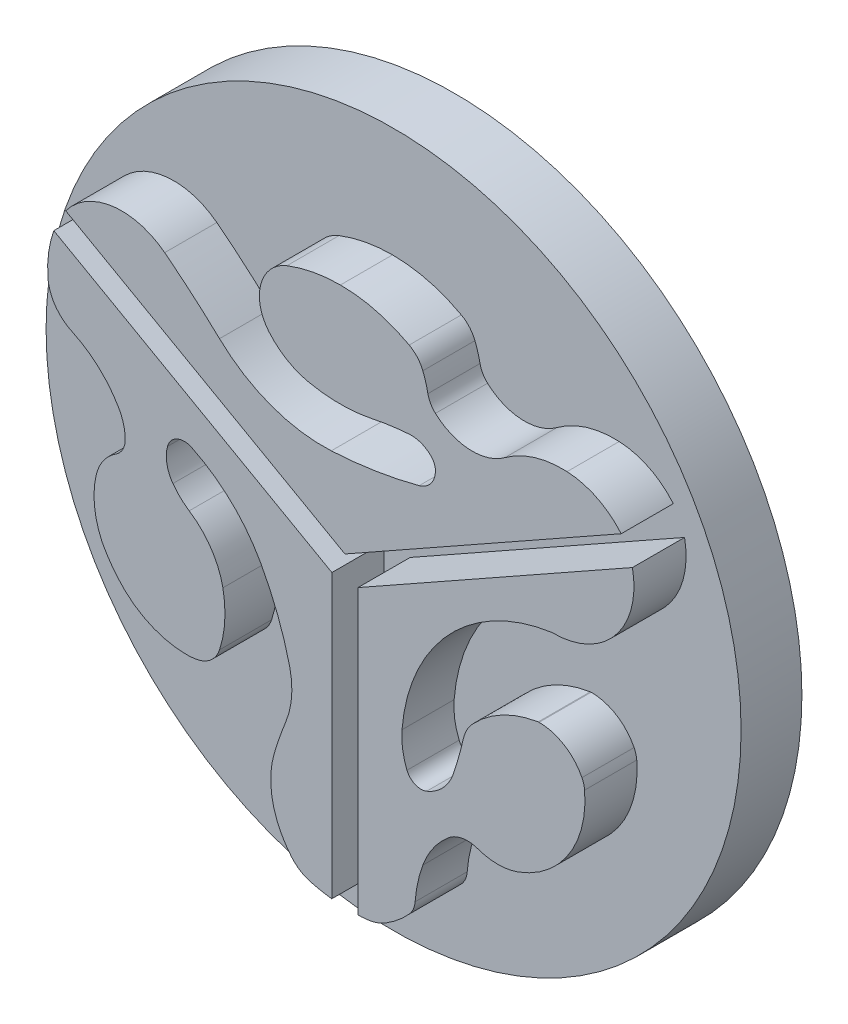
from build123d import *

# Parameters (mm, degrees)
CROQUIS1_R              = 40
SALIENTE_EXTRUIR1_DEPTH = 7
SALIENTE_EXTRUIR2_DEPTH = 6


with BuildPart() as part:
    # Croquis1 → Saliente-Extruir1 (new body)
    with BuildSketch(Plane.XY):
        Circle(CROQUIS1_R)
    extrude(amount=SALIENTE_EXTRUIR1_DEPTH)

    # Croquis2 → Saliente-Extruir2 (add)
    with BuildSketch(Plane.XY.offset(7)):
        with BuildLine():
            Line((-1.100781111, -1.8328966), (-1.1159845, -34.366250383))
            ThreePointArc((-1.1159845, -34.366250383), (-2.349775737, -34.17268454), (-3.567299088, -33.894574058))
            ThreePointArc((-3.567299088, -33.894574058), (-4.770455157, -33.365816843), (-5.754922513, -32.495189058))
            ThreePointArc((-5.754922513, -32.495189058), (-6.399252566, -31.633036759), (-6.954545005, -30.711018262))
            ThreePointArc((-6.954545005, -30.711018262), (-8.08913385, -27.004925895), (-7.728484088, -23.145865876))
            ThreePointArc((-7.728484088, -23.145865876), (-7.109905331, -21.231726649), (-6.399248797, -19.349829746))
            ThreePointArc((-6.399248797, -19.349829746), (-5.734641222, -16.518417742), (-5.964133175, -13.619119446))
            ThreePointArc((-5.964133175, -13.619119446), (-7.347291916, -9.168761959), (-9.317448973, -4.945340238))
            ThreePointArc((-9.317448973, -4.945340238), (-12.694393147, -0.579900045), (-17.238097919, 2.553080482))
            ThreePointArc((-17.238097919, 2.553080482), (-18.927047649, 2.570836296), (-20.019986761, 1.283066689))
            ThreePointArc((-20.019986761, 1.283066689), (-20.094750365, -0.484822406), (-19.400594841, -2.112449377))
            ThreePointArc((-19.400594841, -2.112449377), (-18.546266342, -3.091440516), (-17.527751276, -3.89824154))
            ThreePointArc((-17.527751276, -3.89824154), (-15.01041037, -6.374668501), (-13.649381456, -9.633087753))
            ThreePointArc((-13.649381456, -9.633087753), (-13.430416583, -12.847031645), (-14.036715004, -16.010855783))
            ThreePointArc((-14.036715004, -16.010855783), (-15.005378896, -17.480116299), (-16.583683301, -18.258570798))
            ThreePointArc((-16.583683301, -18.258570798), (-17.221351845, -18.350498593), (-17.865022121, -18.378075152))
            ThreePointArc((-17.865022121, -18.378075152), (-22.205890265, -17.393746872), (-25.737873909, -14.685033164))
            ThreePointArc((-25.737873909, -14.685033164), (-26.635838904, -13.511635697), (-27.417862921, -12.257984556))
            ThreePointArc((-27.417862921, -12.257984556), (-27.512792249, -12.080126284), (-27.600631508, -11.898661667))
            ThreePointArc((-27.600631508, -11.898661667), (-28.434688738, -8.834657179), (-28.228901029, -5.665836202))
            ThreePointArc((-28.228901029, -5.665836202), (-27.406838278, -3.836460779), (-25.95883776, -2.44876625))
            ThreePointArc((-25.95883776, -2.44876625), (-25.17269845, -1.603415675), (-24.887423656, -0.484822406))
            ThreePointArc((-24.887423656, -0.484822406), (-25.074988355, 0.95093929), (-25.625093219, 2.290333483))
            ThreePointArc((-25.625093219, 2.290333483), (-27.93650491, 5.181560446), (-31.018919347, 7.231081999))
            ThreePointArc((-31.018919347, 7.231081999), (-32.961889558, 8.868738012), (-33.794327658, 11.269591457))
            ThreePointArc((-33.794327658, 11.269591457), (-33.704908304, 13.789195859), (-33.112405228, 16.239775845))
            Line((-33.112405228, 16.239775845), (-1.100781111, -1.8328966))
        make_face()
        with BuildLine():
            Line((-31.74345799, 18.903909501), (0.4, 0.764902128))
            Line((0.4, 0.764902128), (32.196222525, 18.681547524))
            ThreePointArc((32.196222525, 18.681547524), (29.402463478, 20.869909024), (25.966746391, 21.758651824))
            ThreePointArc((25.966746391, 21.758651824), (22.204511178, 21.28943569), (18.819338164, 19.582045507))
            ThreePointArc((18.819338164, 19.582045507), (14.743641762, 18.348613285), (10.814503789, 19.990115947))
            ThreePointArc((10.814503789, 19.990115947), (10.258884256, 20.688941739), (9.948827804, 21.526160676))
            ThreePointArc((9.948827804, 21.526160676), (9.701480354, 22.532563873), (9.364987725, 23.512768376))
            ThreePointArc((9.364987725, 23.512768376), (8.736473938, 24.540164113), (7.796039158, 25.292596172))
            ThreePointArc((7.796039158, 25.292596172), (3.965202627, 26.804843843), (-0.121015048, 27.319651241))
            ThreePointArc((-0.121015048, 27.319651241), (-3.255380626, 27.027523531), (-6.281777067, 26.161203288))
            ThreePointArc((-6.281777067, 26.161203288), (-8.405022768, 24.576080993), (-9.413331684, 22.125754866))
            ThreePointArc((-9.413331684, 22.125754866), (-9.250677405, 20.21753343), (-8.337996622, 18.533853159))
            ThreePointArc((-8.337996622, 18.533853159), (-6.281777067, 16.792302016), (-3.771238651, 15.813406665))
            ThreePointArc((-3.771238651, 15.813406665), (-0.121015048, 15.435531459), (3.529208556, 15.813406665))
            ThreePointArc((3.529208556, 15.813406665), (5.652571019, 16.183635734), (7.796039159, 16.410091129))
            ThreePointArc((7.796039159, 16.410091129), (9.142071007, 16.22242928), (10.294450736, 15.501985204))
            ThreePointArc((10.294450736, 15.501985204), (10.679121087, 14.94148994), (10.814503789, 14.275308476))
            ThreePointArc((10.814503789, 14.275308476), (10.294450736, 12.746349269), (8.949999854, 11.851573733))
            ThreePointArc((8.949999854, 11.851573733), (3.929137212, 10.793936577), (-1.174120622, 10.260628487))
            ThreePointArc((-1.174120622, 10.260628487), (-8.094366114, 11.311276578), (-14.036715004, 15.010215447))
            ThreePointArc((-14.036715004, 15.010215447), (-17.123630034, 17.79981202), (-20.346030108, 20.431737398))
            ThreePointArc((-20.346030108, 20.431737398), (-26.364640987, 22.054219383), (-31.74345799, 18.903909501))
        make_face()
        with BuildLine():
            Line((1.899218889, -1.833809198), (1.898158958, -34.480229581))
            ThreePointArc((1.898158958, -34.480229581), (2.404806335, -34.450019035), (2.910408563, -34.40562726))
            ThreePointArc((2.910408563, -34.40562726), (4.052453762, -34.157042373), (5.110013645, -33.659419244))
            ThreePointArc((5.110013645, -33.659419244), (6.530112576, -32.641690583), (7.796039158, -31.437579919))
            ThreePointArc((7.796039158, -31.437579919), (8.26702116, -30.711029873), (8.475475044, -29.87064544))
            ThreePointArc((8.475475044, -29.87064544), (8.780195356, -27.78751405), (9.364987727, -25.76506288))
            ThreePointArc((9.364987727, -25.76506288), (10.551096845, -23.484686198), (12.283741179, -21.586024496))
            ThreePointArc((12.283741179, -21.586024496), (13.901638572, -20.824974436), (15.683435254, -20.97326386))
            ThreePointArc((15.683435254, -20.97326386), (18.040187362, -21.376086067), (20.392092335, -20.9458661))
            ThreePointArc((20.392092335, -20.9458661), (26.202707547, -16.24155354), (27.988105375, -8.981652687))
            ThreePointArc((27.988105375, -8.981652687), (27.886914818, -8.421057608), (27.681479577, -7.889735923))
            ThreePointArc((27.681479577, -7.889735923), (25.647622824, -5.665836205), (22.748544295, -4.842643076))
            ThreePointArc((22.748544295, -4.842643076), (22.693874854, -4.844761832), (22.639533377, -4.851105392))
            ThreePointArc((22.639533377, -4.851105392), (18.553060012, -6.202530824), (15.122087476, -8.80138494))
            ThreePointArc((15.122087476, -8.80138494), (14.4390649, -9.747591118), (14.028469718, -10.839945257))
            ThreePointArc((14.028469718, -10.839945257), (13.503198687, -12.890526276), (12.879849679, -14.913451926))
            ThreePointArc((12.879849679, -14.913451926), (11.701146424, -16.884841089), (9.805605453, -18.182007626))
            ThreePointArc((9.805605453, -18.182007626), (8.475475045, -18.170746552), (7.542893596, -17.222239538))
            ThreePointArc((7.542893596, -17.222239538), (7.036398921, -15.378700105), (6.967762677, -13.468081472))
            ThreePointArc((6.967762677, -13.468081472), (12.38360867, -1.274451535), (24.235013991, 4.854185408))
            ThreePointArc((24.235013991, 4.854185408), (31.509539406, 8.201254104), (33.490845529, 15.959863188))
            Line((33.490845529, 15.959863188), (1.899218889, -1.833809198))
        make_face()
    extrude(amount=SALIENTE_EXTRUIR2_DEPTH)


solid = part.part
